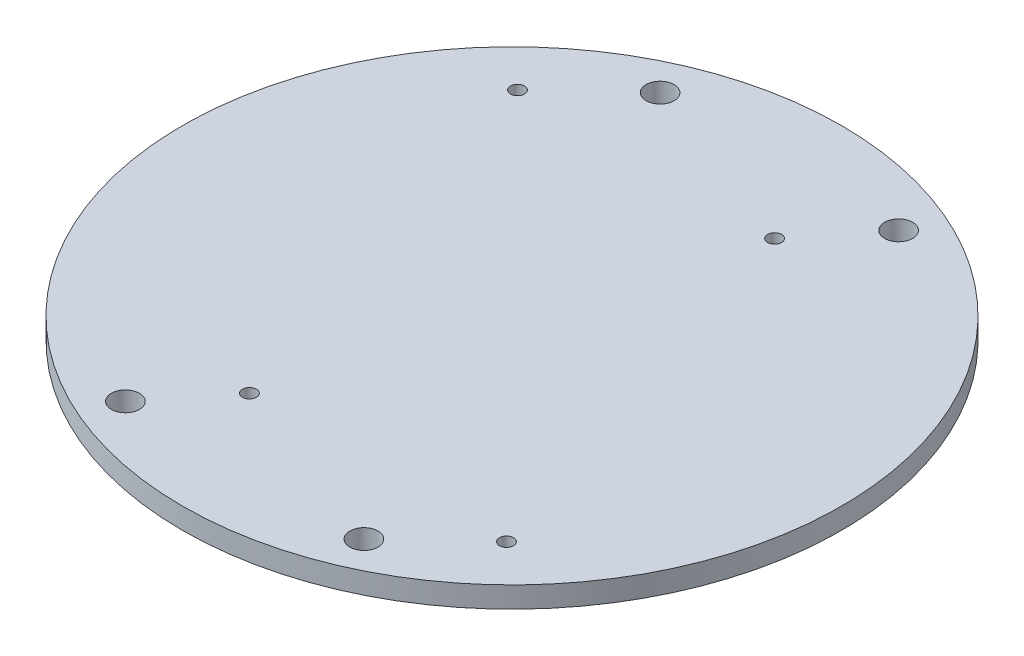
from build123d import *

# Parameters (mm, degrees)
SKETCH1_R           = 47
BASE_DEPTH          = 1.5
SKETCH6_R           = 1
SKETCH6_R_2         = 2
HOLES_PATTERN_DEPTH = 67.535704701


with BuildPart() as part:
    # Sketch1 → Base (new, symmetric)
    with BuildSketch(Plane(origin=(0, 0, 0), x_dir=(1, 0, 0), z_dir=(0, 1, 0))):
        with Locations(Location((0, 0, 0), (0, 0, 270))):
            Circle(SKETCH1_R)
    extrude(amount=BASE_DEPTH, both=True)

    # Sketch6 → Holes Pattern (cut, through all)
    with BuildSketch(Plane(origin=(0, 1.5, 0), x_dir=(1, 0, 0), z_dir=(0, 1, 0))):
        with Locations(Location((27.5, -28.284271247, 0), (0, 0, 270))):
            Circle(SKETCH6_R)
        with Locations(Location((9.166666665, 28.284271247, 0), (0, 0, 270))):
            Circle(SKETCH6_R)
        with Locations(Location((-9.166666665, -28.284271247, 0), (0, 0, 270))):
            Circle(SKETCH6_R)
        with Locations(Location((-27.5, 28.284271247, 0), (0, 0, 270))):
            Circle(SKETCH6_R)
        with Locations(Location((17.009259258, -38.128042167, 0), (0, 0, 270))):
            Circle(SKETCH6_R_2)
        with Locations(Location((17.009259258, 38.128042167, 0), (0, 0, 90))):
            Circle(SKETCH6_R_2)
        with Locations(Location((-17.009259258, 38.128042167, 0), (0, 0, 270))):
            Circle(SKETCH6_R_2)
        with Locations(Location((-17.009259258, -38.128042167, 0), (0, 0, 90))):
            Circle(SKETCH6_R_2)
    extrude(amount=-HOLES_PATTERN_DEPTH, mode=Mode.SUBTRACT)


solid = part.part
